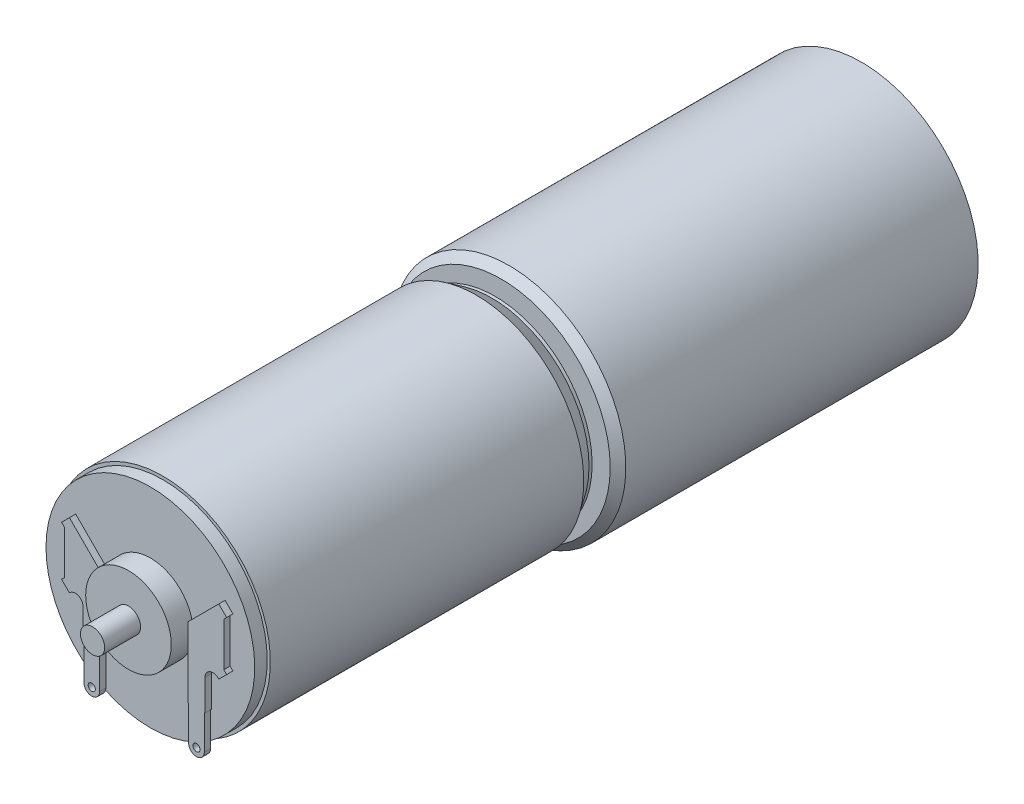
from build123d import *

# Parameters (mm, degrees)
SKETCH2_R           = 18.9738
BASE_EXTRUDE_DEPTH  = 58.547
CHAMFER1_SIZE       = 1.27
BOSS_EXTRUDE1_DEPTH = 1.016
SKETCH5_R           = 0.581172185
CUT_EXTRUDE1_DEPTH  = 1.016


with BuildPart() as part:
    # Sketch2 → Base-Extrude (new body)
    with BuildSketch(Plane.XY):
        with Locations(Location((0, 0, 0), (0, 0, 180))):
            Circle(SKETCH2_R)
    extrude(amount=BASE_EXTRUDE_DEPTH)

    # Chamfer1
    chamfer1_edges = [part.edges().sort_by_distance(p)[0] for p in [
        (18.9738, 0, 58.547),
    ]]
    chamfer(chamfer1_edges, length=CHAMFER1_SIZE)

    # Sketch3 → Boss-Revolve1 (revolve)
    with BuildSketch(Plane(origin=(0, 0, 0), x_dir=(0, 0, -1), z_dir=(1, 0, 0)), mode=Mode.PRIVATE) as boss_revolve1_sk:
        Polygon((-62.611, 17.4752), (-113.5634, 17.4752), (-113.5634, 16.9672), (-115.5954, 16.9672), (-115.5954, 6.9596), (-119.1514, 6.9596), (-119.1514, 1.9685), (-124.9934, 1.9685), (-124.9934, 0), (-58.547, 0), (-58.547, 14.224), (-59.563, 15.7861), (-60.071, 15.7861), align=None)
    revolve(boss_revolve1_sk.sketch.rotate(Axis((0, 0, 0), (0, 0, 1)), 90), axis=Axis((0, 0, 0), (0, 0, 1)))

    # Sketch4 → Boss-Extrude1 (add)
    with BuildSketch(Plane.XY.offset(115.5954)):
        with BuildLine():
            Line((12.140943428, 7.060943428), (7.112, 2.032))
            Line((7.112, 2.032), (7.112, -9.398))
            Line((7.112, -9.398), (7.242990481, -9.398))
            Line((7.242990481, -9.398), (7.242990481, -14.986))
            ThreePointArc((7.242990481, -14.986), (8.512990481, -16.256), (9.782990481, -14.986))
            Line((9.782990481, -14.986), (9.782990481, -9.398))
            Line((9.782990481, -9.398), (9.913980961, -9.398))
            Line((9.913980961, -9.398), (9.913980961, -4.364817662))
            ThreePointArc((9.913980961, -4.364817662), (10.697973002, -3.191490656), (12.082006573, -3.46679205))
            Line((12.082006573, -3.46679205), (12.140943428, -3.525728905))
            Line((12.140943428, -3.525728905), (13.416139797, -2.250532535))
            Line((13.416139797, -2.250532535), (12.954, -1.788392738))
            Line((12.954, -1.788392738), (12.954, 5.323607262))
            Line((12.954, 5.323607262), (13.416139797, 5.785747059))
            Line((13.416139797, 5.785747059), (12.140943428, 7.060943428))
        make_face()
        with BuildLine():
            Line((-9.913980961, -9.398), (-9.913980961, -4.364817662))
            ThreePointArc((-9.913980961, -4.364817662), (-10.697973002, -3.191490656), (-12.082006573, -3.46679205))
            Line((-12.082006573, -3.46679205), (-12.140943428, -3.525728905))
            Line((-12.140943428, -3.525728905), (-13.416139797, -2.250532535))
            Line((-13.416139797, -2.250532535), (-12.954, -1.788392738))
            Line((-12.954, -1.788392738), (-12.954, 5.323607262))
            Line((-12.954, 5.323607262), (-13.416139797, 5.785747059))
            Line((-13.416139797, 5.785747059), (-12.140943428, 7.060943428))
            Line((-12.140943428, 7.060943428), (-7.112, 2.032))
            Line((-7.112, 2.032), (-7.112, -9.398))
            Line((-7.112, -9.398), (-7.242990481, -9.398))
            Line((-7.242990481, -9.398), (-7.242990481, -14.986))
            ThreePointArc((-7.242990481, -14.986), (-8.512990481, -16.256), (-9.782990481, -14.986))
            Line((-9.782990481, -14.986), (-9.782990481, -9.398))
            Line((-9.782990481, -9.398), (-9.913980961, -9.398))
        make_face()
    extrude(amount=BOSS_EXTRUDE1_DEPTH)

    # Sketch5 → Cut-Extrude1 (cut)
    with BuildSketch(Plane.XY.offset(116.6114)):
        with Locations((8.512990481, -14.986)):
            Circle(SKETCH5_R)
        with Locations(Location((-8.512990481, -14.986, 0), (0, 0, 358.718831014))):
            Circle(SKETCH5_R)
    extrude(amount=-CUT_EXTRUDE1_DEPTH, mode=Mode.SUBTRACT)


solid = part.part
